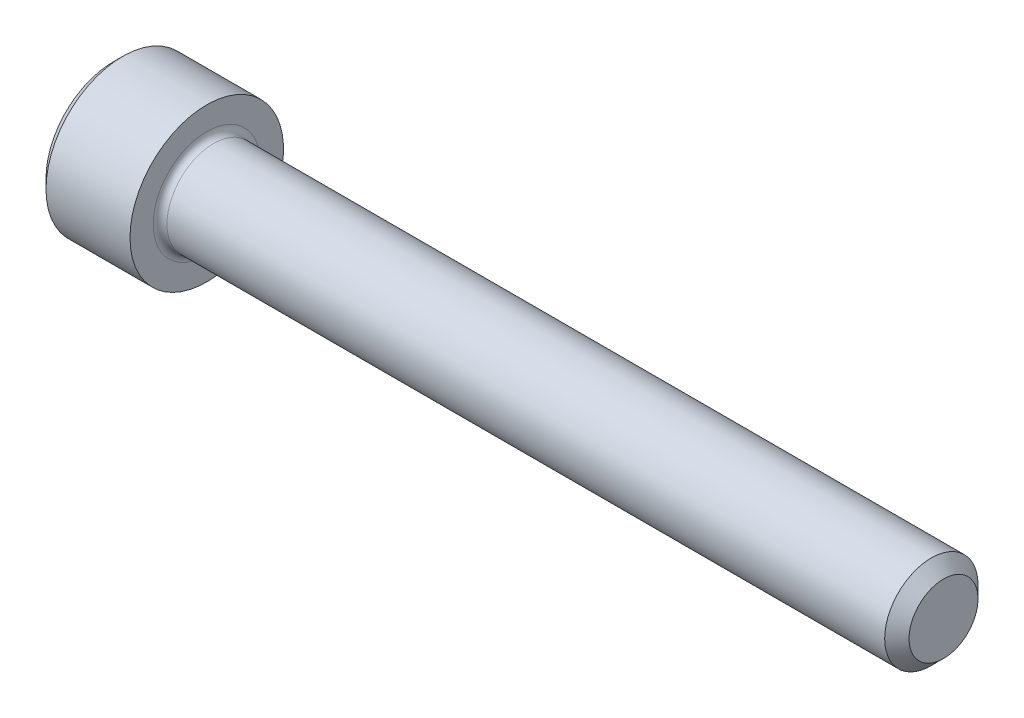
from build123d import *

# Parameters (mm, degrees)
FILLET1_R   = 0.3556
HEX_2_DEPTH = 2.286


with BuildPart() as part:
    # BodySke → Base-Revolve (revolve)
    with BuildSketch(Plane.XY, mode=Mode.PRIVATE) as base_revolve_sk:
        Polygon((0, 0), (0, 3.48615), (0.4826, 3.96875), (4.826, 3.96875), (4.826, 2.413), (42.29608, 2.413), (42.926, 1.78308), (42.926, 0), align=None)
    revolve(base_revolve_sk.sketch.rotate(Axis((-31.75, 0, 0), (1, 0, 0)), 90), axis=Axis((-31.75, 0, 0), (1, 0, 0)))

    # Fillet1
    fillet1_edges = [part.edges().sort_by_distance(p)[0] for p in [
        (4.826, 0, -2.413),
    ]]
    fillet(fillet1_edges, radius=FILLET1_R)

    # Sketch2 → Hex-PreBroach (revolve, cut)
    with BuildSketch(Plane.XY, mode=Mode.PRIVATE) as hex_prebroach_sk:
        Polygon((0, 1.98501), (2.286, 1.98501), (3.432046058, 0), (0, 0), align=None)
    revolve(hex_prebroach_sk.sketch.rotate(Axis((0, 0, 0), (1, 0, 0)), 90), axis=Axis((0, 0, 0), (1, 0, 0)), mode=Mode.SUBTRACT)

    # Sketch3 → Hex 2 (cut)
    with BuildSketch(Plane(origin=(0, 0, 0), x_dir=(0, 0.500000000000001, 0.866025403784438), z_dir=(-1, 0, 0))):
        Polygon((1.146046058, 1.98501), (-1.146046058, 1.98501), (-2.292092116, 0), (-1.146046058, -1.98501), (1.146046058, -1.98501), (2.292092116, 0), align=None)
    extrude(amount=-HEX_2_DEPTH, mode=Mode.SUBTRACT)


solid = part.part
